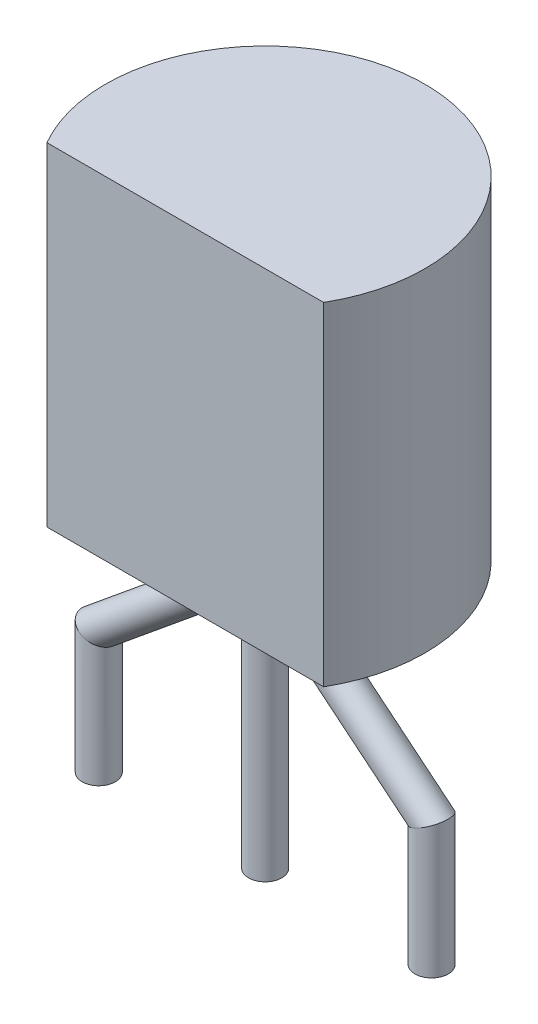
from build123d import *

# Parameters (mm, degrees)
EXTRUSION1_DEPTH = 5
ESQUISSE6_R      = 0.25
ESQUISSE8_R      = 0.25
ESQUISSE10_R     = 0.25


with BuildPart() as part:
    # Esquisse2 → Extrusion1 (new body)
    with BuildSketch(Plane(origin=(0, 0, 0), x_dir=(1, 0, 0), z_dir=(0, 1, 0))):
        with BuildLine():
            Line((-2.078460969, -1.2), (2.078460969, -1.2))
            ThreePointArc((2.078460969, -1.2), (0, 2.4), (-2.078460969, -1.2))
        make_face()
    extrude(amount=EXTRUSION1_DEPTH)

    # Balayage1: sweep along a path in Esquisse7
    with BuildLine(Plane.XY) as balayage1_path:
        Line((0, 0), (0, -4))
    # Esquisse6 → Balayage1 (sweep)
    with BuildSketch(Plane.XZ):
        Circle(ESQUISSE6_R)
    sweep(path=balayage1_path.line)

    # Balayage2: sweep along a path in Esquisse9
    with BuildLine(Plane.XY) as balayage2_path:
        Line((-1, 0), (-1, -0.87102627))
        Line((-1, -0.87102627), (-2.5, -2.102469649))
        Line((-2.5, -2.102469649), (-2.5, -4))
    # Esquisse8 → Balayage2 (sweep)
    with BuildSketch(Plane.XZ):
        with Locations((-1, 0)):
            Circle(ESQUISSE8_R)
    sweep(path=balayage2_path.line, transition=Transition.RIGHT)

    # Balayage3: sweep along a path in Esquisse11
    with BuildLine(Plane.XY) as balayage3_path:
        Line((1, 0), (1, -0.87102627))
        Line((1, -0.87102627), (2.5, -2.102469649))
        Line((2.5, -2.102469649), (2.5, -4))
    # Esquisse10 → Balayage3 (sweep)
    with BuildSketch(Plane.XZ):
        with Locations((1, 0)):
            Circle(ESQUISSE10_R)
    sweep(path=balayage3_path.line, transition=Transition.RIGHT)


solid = part.part
